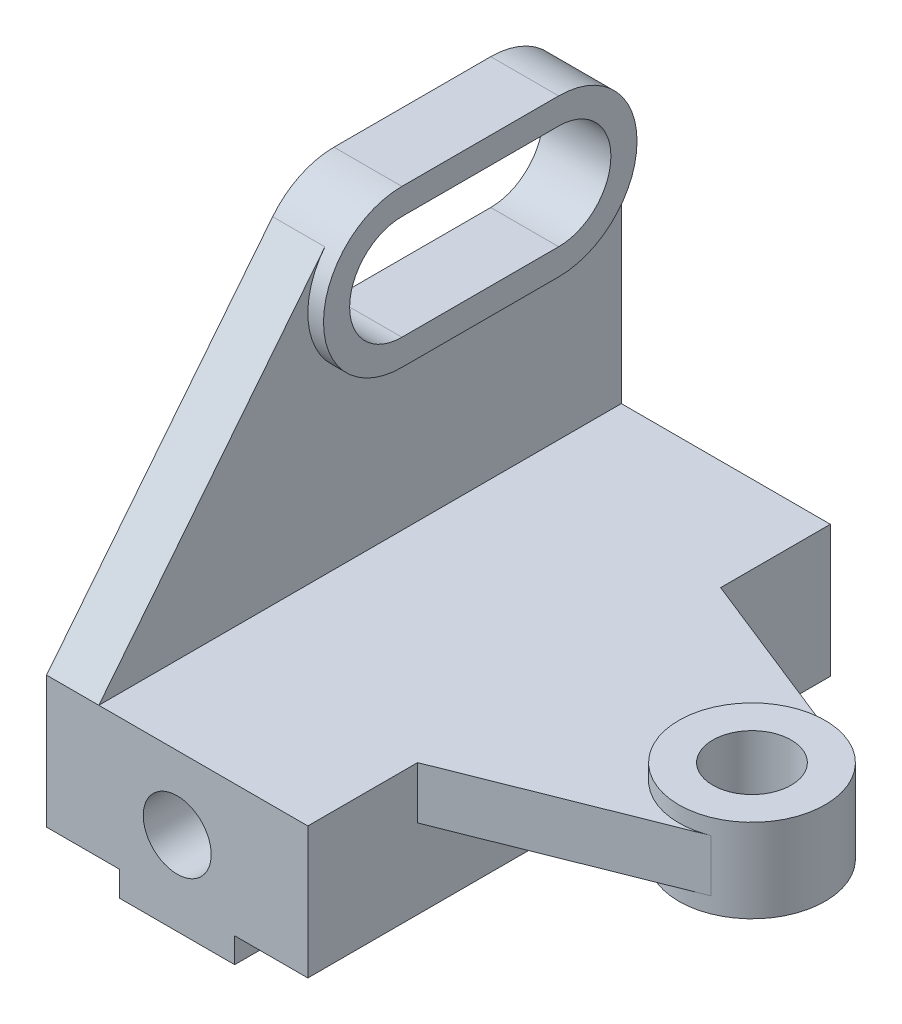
from build123d import *

# Parameters (mm, degrees)
SKETCH1_W           = 50
SKETCH1_H           = 100
BOSS_EXTRUDE1_DEPTH = 25.2
SKETCH1_3_W         = 22
SKETCH1_3_H         = 100
BOSS_EXTRUDE2_DEPTH = 4.8
BOSS_EXTRUDE4_START = 25.2
SKETCH1_4_R         = 7.5
BOSS_EXTRUDE4_DEPTH = 10
BOSS_EXTRUDE5_START = 28.2
SKETCH1_5_R         = 14
SKETCH1_5_R_2       = 7.5
BOSS_EXTRUDE5_DEPTH = 3
BOSS_EXTRUDE6_START = 15.2
SKETCH1_6_R         = 14
SKETCH1_6_R_2       = 7.5
SKETCH1_6_W         = 50
SKETCH1_6_H         = 100
BOSS_EXTRUDE6_DEPTH = 3
BOSS_EXTRUDE7_DEPTH = 10
BOSS_EXTRUDE8_START = -10
BOSS_EXTRUDE8_DEPTH = 3
SKETCH3_R           = 6.5
CUT_EXTRUDE1_DEPTH  = 165.499361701


with BuildPart() as part:
    # Sketch1 → Boss-Extrude1 (new body)
    with BuildSketch(Plane(origin=(0, 0, 0), x_dir=(1, 0, 0), z_dir=(0, 1, 0))):
        with Locations((25, 50)):
            Rectangle(SKETCH1_W, SKETCH1_H)
    extrude(amount=BOSS_EXTRUDE1_DEPTH)

    # Sketch1_3 → Boss-Extrude2 (add)
    with BuildSketch(Plane(origin=(0, 0, 0), x_dir=(1, 0, 0), z_dir=(0, 1, 0))):
        with Locations((25, 50)):
            Rectangle(SKETCH1_3_W, SKETCH1_3_H)
    extrude(amount=-BOSS_EXTRUDE2_DEPTH)

    # Sketch1_4 → Boss-Extrude4 (add)
    with BuildSketch(Plane(origin=(0, 0, 0), x_dir=(1, 0, 0), z_dir=(0, 1, 0)).offset(BOSS_EXTRUDE4_START)):
        with BuildLine():
            Line((90.177570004, 63.007412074), (50, 79))
            Line((50, 79), (50, 21))
            Line((50, 21), (90.177570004, 36.992587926))
            ThreePointArc((90.177570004, 36.992587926), (99, 50), (90.177570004, 63.007412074))
        make_face()
        with Locations(Location((85, 50, 0), (0, 0, 270))):
            Circle(SKETCH1_4_R, mode=Mode.SUBTRACT)
    extrude(amount=-BOSS_EXTRUDE4_DEPTH)

    # Sketch1_5 → Boss-Extrude5 (add)
    with BuildSketch(Plane(origin=(0, 0, 0), x_dir=(1, 0, 0), z_dir=(0, 1, 0)).offset(BOSS_EXTRUDE5_START)):
        with Locations(Location((85, 50, 0), (0, 0, 270))):
            Circle(SKETCH1_5_R)
        with Locations(Location((85, 50, 0), (0, 0, 270))):
            Circle(SKETCH1_5_R_2, mode=Mode.SUBTRACT)
    extrude(amount=-BOSS_EXTRUDE5_DEPTH)

    # Sketch1_6 → Boss-Extrude6 (add)
    # profile 1 of 2: a face of its own
    with BuildSketch(Plane(origin=(0, 0, 0), x_dir=(1, 0, 0), z_dir=(0, 1, 0)).offset(BOSS_EXTRUDE6_START)):
        with Locations(Location((85, 50, 0), (0, 0, 270))):
            Circle(SKETCH1_6_R)
        with Locations(Location((85, 50, 0), (0, 0, 270))):
            Circle(SKETCH1_6_R_2, mode=Mode.SUBTRACT)
    # profile 2 of 2: a face of its own
    with BuildSketch(Plane(origin=(0, 0, 0), x_dir=(1, 0, 0), z_dir=(0, 1, 0)).offset(BOSS_EXTRUDE6_START)):
        with Locations((25, 50)):
            Rectangle(SKETCH1_6_W, SKETCH1_6_H)
    extrude(amount=-BOSS_EXTRUDE6_DEPTH)

    # Sketch2 → Boss-Extrude7 (add)
    # profile 1 of 2: a face of its own
    with BuildSketch(Plane.ZY):
        with BuildLine():
            Line((-100, 25.2), (0, 25.2))
            Line((0, 25.2), (-43.264950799, 79.542837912))
            ThreePointArc((-43.264950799, 79.542837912), (-41.48810582, 63.686267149), (-55, 55.2))
            Line((-55, 55.2), (-85, 55.2))
            ThreePointArc((-85, 55.2), (-95.606601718, 59.593398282), (-100, 70.2))
            Line((-100, 70.2), (-100, 25.2))
        make_face()
    # profile 2 of 2: a face of its own
    with BuildSketch(Plane.ZY):
        with BuildLine():
            Line((-55, 85.2), (-85, 85.2))
            ThreePointArc((-85, 85.2), (-100, 70.2), (-85, 55.2))
            Line((-85, 55.2), (-55, 55.2))
            ThreePointArc((-55, 55.2), (-40, 70.2), (-55, 85.2))
        make_face()
        with BuildLine():
            ThreePointArc((-55, 60.2), (-45, 70.2), (-55, 80.2))
            Line((-55, 80.2), (-85, 80.2))
            ThreePointArc((-85, 80.2), (-95, 70.2), (-85, 60.2))
            Line((-85, 60.2), (-55, 60.2))
        make_face(mode=Mode.SUBTRACT)
    extrude(amount=-BOSS_EXTRUDE7_DEPTH)

    # Sketch2_3 → Boss-Extrude8 (add)
    with BuildSketch(Plane.ZY.offset(BOSS_EXTRUDE8_START)):
        with BuildLine():
            Line((-55, 85.2), (-85, 85.2))
            ThreePointArc((-85, 85.2), (-100, 70.2), (-85, 55.2))
            Line((-85, 55.2), (-55, 55.2))
            ThreePointArc((-55, 55.2), (-40, 70.2), (-55, 85.2))
        make_face()
        with BuildLine():
            ThreePointArc((-55, 60.2), (-45, 70.2), (-55, 80.2))
            Line((-55, 80.2), (-85, 80.2))
            ThreePointArc((-85, 80.2), (-95, 70.2), (-85, 60.2))
            Line((-85, 60.2), (-55, 60.2))
        make_face(mode=Mode.SUBTRACT)
    extrude(amount=-BOSS_EXTRUDE8_DEPTH)

    # Sketch3 → Cut-Extrude1 (cut, through all)
    with BuildSketch(Plane.XY):
        with Locations((25, 11.2)):
            Circle(SKETCH3_R)
    extrude(amount=-CUT_EXTRUDE1_DEPTH, mode=Mode.SUBTRACT)


solid = part.part
